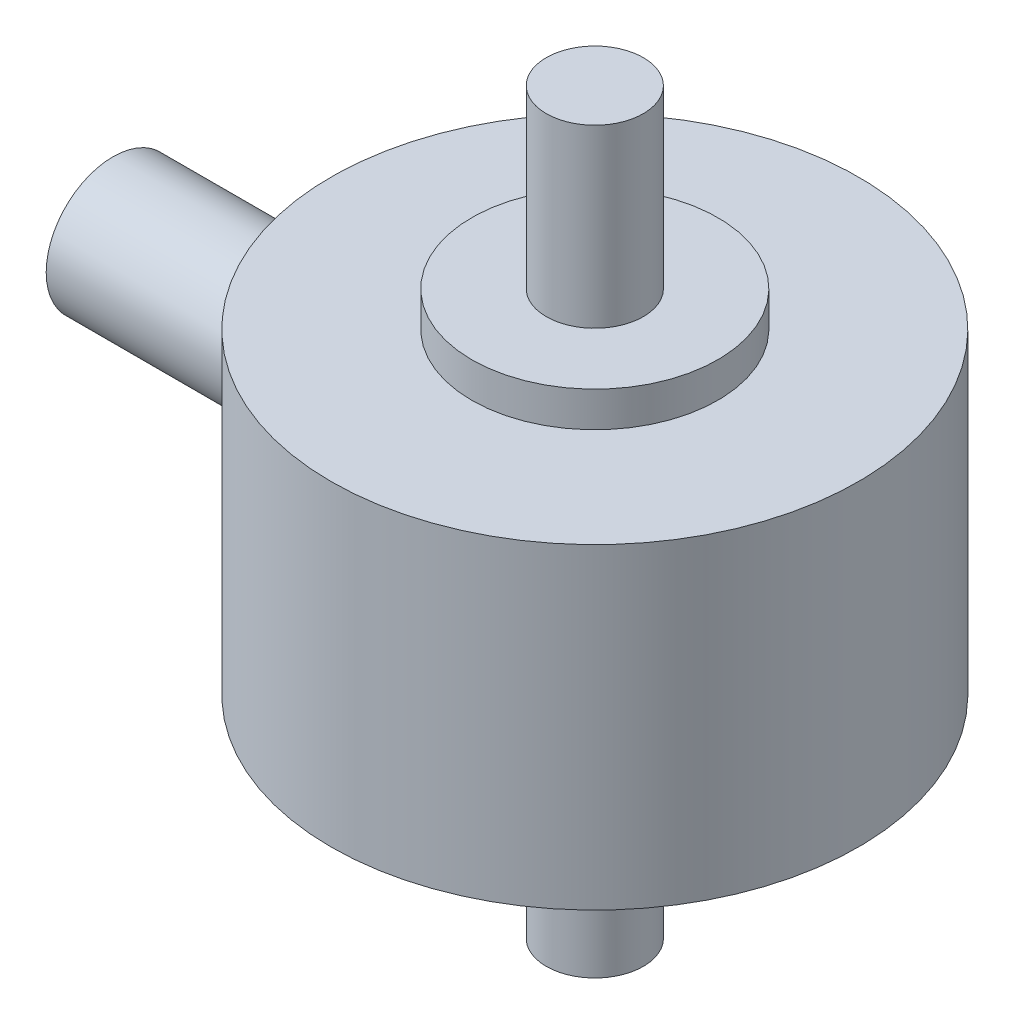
ISO-10303-21;
HEADER;
FILE_DESCRIPTION(('STEP AP214'),'2;1');
FILE_NAME('part.step','',(''),(''),'','','');
FILE_SCHEMA(('AUTOMOTIVE_DESIGN { 1 0 10303 214 1 1 1 1 }'));
ENDSEC;
DATA;
#1=APPLICATION_CONTEXT('core data for automotive mechanical design processes');
#2=APPLICATION_PROTOCOL_DEFINITION('international standard','automotive_design',2000,#1);
#3=PRODUCT_CONTEXT('',#1,'mechanical');
#4=PRODUCT('Part','Part','',(#3));
#5=PRODUCT_RELATED_PRODUCT_CATEGORY('part','',(#4));
#6=PRODUCT_DEFINITION_FORMATION('','',#4);
#7=PRODUCT_DEFINITION_CONTEXT('part definition',#1,'design');
#8=PRODUCT_DEFINITION('design','',#6,#7);
#9=PRODUCT_DEFINITION_SHAPE('','',#8);
#10=(LENGTH_UNIT() NAMED_UNIT(*) SI_UNIT(.MILLI.,.METRE.));
#11=(NAMED_UNIT(*) PLANE_ANGLE_UNIT() SI_UNIT($,.RADIAN.));
#12=(NAMED_UNIT(*) SI_UNIT($,.STERADIAN.) SOLID_ANGLE_UNIT());
#13=UNCERTAINTY_MEASURE_WITH_UNIT(LENGTH_MEASURE(1.E-05),#10,'distance_accuracy_value','');
#14=(GEOMETRIC_REPRESENTATION_CONTEXT(3) GLOBAL_UNCERTAINTY_ASSIGNED_CONTEXT((#13)) GLOBAL_UNIT_ASSIGNED_CONTEXT((#10,
#11,#12)) REPRESENTATION_CONTEXT('',''));
#15=CARTESIAN_POINT('',(0.,0.,0.));
#16=DIRECTION('',(0.,0.,1.));
#17=DIRECTION('',(1.,0.,0.));
#18=AXIS2_PLACEMENT_3D('',#15,#16,#17);
#19=CARTESIAN_POINT('',(0.,5.715,0.));
#20=DIRECTION('',(0.,-1.,0.));
#21=DIRECTION('',(0.,0.,-1.));
#22=AXIS2_PLACEMENT_3D('',#19,#20,#21);
#23=CYLINDRICAL_SURFACE('',#22,9.525);
#24=CARTESIAN_POINT('',(0.,-5.715,0.));
#25=DIRECTION('',(0.,1.,0.));
#26=DIRECTION('',(0.,0.,1.));
#27=AXIS2_PLACEMENT_3D('',#24,#25,#26);
#28=CIRCLE('',#27,9.525);
#29=CARTESIAN_POINT('',(0.,-5.715,9.525));
#30=VERTEX_POINT('',#29);
#31=EDGE_CURVE('E63',#30,#30,#28,.T.);
#32=ORIENTED_EDGE('',*,*,#31,.T.);
#33=EDGE_LOOP('',(#32));
#34=FACE_BOUND('',#33,.T.);
#35=CARTESIAN_POINT('',(0.,5.715,0.));
#36=DIRECTION('',(0.,1.,0.));
#37=DIRECTION('',(0.,0.,1.));
#38=AXIS2_PLACEMENT_3D('',#35,#36,#37);
#39=CIRCLE('',#38,9.525);
#40=CARTESIAN_POINT('',(0.,5.715,9.525));
#41=VERTEX_POINT('',#40);
#42=EDGE_CURVE('E46',#41,#41,#39,.T.);
#43=ORIENTED_EDGE('',*,*,#42,.F.);
#44=EDGE_LOOP('',(#43));
#45=FACE_BOUND('',#44,.T.);
#46=CARTESIAN_POINT('',(-9.21428543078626,0.,-2.413));
#47=CARTESIAN_POINT('',(-9.21428793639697,-0.133184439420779,-2.41299632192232));
#48=CARTESIAN_POINT('',(-9.21720456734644,-0.26640921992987,-2.40193585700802));
#49=CARTESIAN_POINT('',(-9.22852516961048,-0.529028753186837,-2.35805935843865));
#50=CARTESIAN_POINT('',(-9.23693224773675,-0.658421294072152,-2.32523100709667));
#51=CARTESIAN_POINT('',(-9.25822186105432,-0.909539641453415,-2.23895287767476));
#52=CARTESIAN_POINT('',(-9.27109851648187,-1.03127527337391,-2.1855301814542));
#53=CARTESIAN_POINT('',(-9.29986905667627,-1.26407058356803,-2.05966279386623));
#54=CARTESIAN_POINT('',(-9.31576309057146,-1.37512973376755,-1.98721716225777));
#55=CARTESIAN_POINT('',(-9.34917957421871,-1.58592848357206,-1.82361180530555));
#56=CARTESIAN_POINT('',(-9.36672860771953,-1.68539129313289,-1.73210080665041));
#57=CARTESIAN_POINT('',(-9.40124737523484,-1.86773388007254,-1.53371876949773));
#58=CARTESIAN_POINT('',(-9.41821705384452,-1.95061207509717,-1.42684626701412));
#59=CARTESIAN_POINT('',(-9.44995970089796,-2.09856951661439,-1.19887421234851));
#60=CARTESIAN_POINT('',(-9.46469764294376,-2.16337621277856,-1.07759247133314));
#61=CARTESIAN_POINT('',(-9.49001263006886,-2.27157784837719,-0.825420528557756));
#62=CARTESIAN_POINT('',(-9.50059030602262,-2.31497603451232,-0.694531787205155));
#63=CARTESIAN_POINT('',(-9.51620500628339,-2.37824036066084,-0.429747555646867));
#64=CARTESIAN_POINT('',(-9.52135258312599,-2.39857669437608,-0.295971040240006));
#65=CARTESIAN_POINT('',(-9.52591259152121,-2.41661661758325,-0.0268127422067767));
#66=CARTESIAN_POINT('',(-9.52532589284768,-2.41432363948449,0.108568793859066));
#67=CARTESIAN_POINT('',(-9.51856549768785,-2.38750682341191,0.373830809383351));
#68=CARTESIAN_POINT('',(-9.5125193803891,-2.36349060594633,0.503766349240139));
#69=CARTESIAN_POINT('',(-9.49566843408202,-2.29472578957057,0.757699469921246));
#70=CARTESIAN_POINT('',(-9.4848633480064,-2.249976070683,0.881696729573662));
#71=CARTESIAN_POINT('',(-9.45951452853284,-2.14060807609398,1.12156270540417));
#72=CARTESIAN_POINT('',(-9.44493725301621,-2.07581046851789,1.2373459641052));
#73=CARTESIAN_POINT('',(-9.41362324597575,-1.92832240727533,1.45657235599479));
#74=CARTESIAN_POINT('',(-9.39688612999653,-1.84562876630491,1.56001328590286));
#75=CARTESIAN_POINT('',(-9.36252584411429,-1.66197992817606,1.75464665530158));
#76=CARTESIAN_POINT('',(-9.34489097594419,-1.56058130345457,1.84541908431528));
#77=CARTESIAN_POINT('',(-9.31114696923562,-1.34381670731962,2.0087667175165));
#78=CARTESIAN_POINT('',(-9.29503790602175,-1.22845004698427,2.08134102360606));
#79=CARTESIAN_POINT('',(-9.266126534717,-0.986183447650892,2.20651099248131));
#80=CARTESIAN_POINT('',(-9.25334148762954,-0.859227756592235,2.25900301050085));
#81=CARTESIAN_POINT('',(-9.2327456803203,-0.59789088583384,2.34176662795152));
#82=CARTESIAN_POINT('',(-9.22493382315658,-0.463511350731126,2.37204312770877));
#83=CARTESIAN_POINT('',(-9.21539979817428,-0.19504289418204,2.40881412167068));
#84=CARTESIAN_POINT('',(-9.21351837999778,-0.0610447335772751,2.4159307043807));
#85=CARTESIAN_POINT('',(-9.2156243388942,0.206225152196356,2.40788507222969));
#86=CARTESIAN_POINT('',(-9.21961115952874,0.339496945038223,2.39272496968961));
#87=CARTESIAN_POINT('',(-9.23285153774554,0.599204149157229,2.34110235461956));
#88=CARTESIAN_POINT('',(-9.24201491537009,0.725717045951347,2.30500431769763));
#89=CARTESIAN_POINT('',(-9.26448982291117,0.970895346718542,2.21293574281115));
#90=CARTESIAN_POINT('',(-9.27780185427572,1.08955979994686,2.15696280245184));
#91=CARTESIAN_POINT('',(-9.30740778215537,1.31830212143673,2.02543888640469));
#92=CARTESIAN_POINT('',(-9.32375619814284,1.42815966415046,1.949517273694));
#93=CARTESIAN_POINT('',(-9.35746016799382,1.63380390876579,1.78071798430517));
#94=CARTESIAN_POINT('',(-9.37481589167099,1.72958822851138,1.68783744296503));
#95=CARTESIAN_POINT('',(-9.40912030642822,1.90689919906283,1.48489744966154));
#96=CARTESIAN_POINT('',(-9.42604698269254,1.98799482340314,1.37445698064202));
#97=CARTESIAN_POINT('',(-9.45712393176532,2.13049030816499,1.14116545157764));
#98=CARTESIAN_POINT('',(-9.47127435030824,2.1918912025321,1.01831504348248));
#99=CARTESIAN_POINT('',(-9.49511464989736,2.29271442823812,0.764544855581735));
#100=CARTESIAN_POINT('',(-9.50483681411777,2.33229628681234,0.633691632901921));
#101=CARTESIAN_POINT('',(-9.51886666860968,2.38883389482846,0.366911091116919));
#102=CARTESIAN_POINT('',(-9.52317543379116,2.40579413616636,0.230984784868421));
#103=CARTESIAN_POINT('',(-9.52584778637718,2.41634873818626,-0.0380386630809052));
#104=CARTESIAN_POINT('',(-9.52437303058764,2.41057842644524,-0.171109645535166));
#105=CARTESIAN_POINT('',(-9.51600391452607,2.37729481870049,-0.434320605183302));
#106=CARTESIAN_POINT('',(-9.50910972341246,2.34978220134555,-0.56446067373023));
#107=CARTESIAN_POINT('',(-9.49070278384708,2.27413945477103,-0.817431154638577));
#108=CARTESIAN_POINT('',(-9.47921641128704,2.22612696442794,-0.940298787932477));
#109=CARTESIAN_POINT('',(-9.45283293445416,2.11095366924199,-1.17630405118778));
#110=CARTESIAN_POINT('',(-9.43793539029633,2.04379039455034,-1.28944042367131));
#111=CARTESIAN_POINT('',(-9.40587755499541,1.89029971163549,-1.505773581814));
#112=CARTESIAN_POINT('',(-9.38867077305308,1.80354314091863,-1.60865898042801));
#113=CARTESIAN_POINT('',(-9.35413865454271,1.61415802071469,-1.79862656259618));
#114=CARTESIAN_POINT('',(-9.33681328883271,1.51152542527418,-1.8857047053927));
#115=CARTESIAN_POINT('',(-9.30362422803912,1.29091823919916,-2.04323817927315));
#116=CARTESIAN_POINT('',(-9.28779518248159,1.1726858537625,-2.11334038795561));
#117=CARTESIAN_POINT('',(-9.25986152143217,0.925729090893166,-2.23256926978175));
#118=CARTESIAN_POINT('',(-9.24775425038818,0.797012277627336,-2.28171090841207));
#119=CARTESIAN_POINT('',(-9.23048638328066,0.557140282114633,-2.35047862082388));
#120=CARTESIAN_POINT('',(-9.22445740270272,0.447112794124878,-2.37387227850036));
#121=CARTESIAN_POINT('',(-9.21635604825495,0.224732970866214,-2.40513381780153));
#122=CARTESIAN_POINT('',(-9.2142833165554,0.112380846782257,-2.41300310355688));
#123=CARTESIAN_POINT('',(-9.21428543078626,0.,-2.413));
#124=B_SPLINE_CURVE_WITH_KNOTS('',3,(#46,#47,#48,#49,#50,#51,#52,#53,#54,#55,#56,#57,#58,#59,
#60,#61,#62,#63,#64,#65,#66,#67,#68,#69,#70,#71,#72,#73,#74,#75,#76,#77,#78,#79,#80,#81,#82,#83,
#84,#85,#86,#87,#88,#89,#90,#91,#92,#93,#94,#95,#96,#97,#98,#99,#100,#101,#102,#103,#104,#105,
#106,#107,#108,#109,#110,#111,#112,#113,#114,#115,#116,#117,#118,#119,#120,#121,#122,#123),
.UNSPECIFIED.,.T.,.F.,(4,2,2,2,2,2,2,2,2,2,2,2,2,2,2,2,2,2,2,2,2,2,2,2,2,2,2,2,2,2,2,2,2,2,2,2,
2,2,4),(0.,0.399140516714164,0.798507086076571,1.19735026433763,1.59621315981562,
2.00320412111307,2.41023389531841,2.82310593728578,3.23591534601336,3.64014776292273,
4.04431886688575,4.43928274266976,4.83426795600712,5.23289385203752,5.63159080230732,
6.04136176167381,6.45115293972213,6.86303140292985,7.27481898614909,7.67545025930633,
8.0760435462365,8.46986432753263,8.86373272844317,9.26551179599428,9.66735879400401,
10.0795613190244,10.4917422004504,10.9008680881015,11.3099127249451,11.7076066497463,
12.1052881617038,12.5007176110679,12.896198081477,13.3013667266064,13.7066387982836,
14.1197299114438,14.5325255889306,14.8693502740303,15.2061444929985),.UNSPECIFIED.);
#125=CARTESIAN_POINT('',(-9.21428543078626,0.,-2.413));
#126=VERTEX_POINT('',#125);
#127=EDGE_CURVE('E10',#126,#126,#124,.T.);
#128=ORIENTED_EDGE('',*,*,#127,.F.);
#129=EDGE_LOOP('',(#128));
#130=FACE_BOUND('',#129,.T.);
#131=ADVANCED_FACE('F28',(#34,#45,#130),#23,.T.);
#132=CARTESIAN_POINT('',(0.,6.985,0.));
#133=DIRECTION('',(0.,1.,0.));
#134=DIRECTION('',(0.,0.,1.));
#135=AXIS2_PLACEMENT_3D('',#132,#133,#134);
#136=PLANE('',#135);
#137=CARTESIAN_POINT('',(0.,6.985,0.));
#138=DIRECTION('',(0.,1.,0.));
#139=DIRECTION('',(0.,0.,1.));
#140=AXIS2_PLACEMENT_3D('',#137,#138,#139);
#141=CIRCLE('',#140,4.445);
#142=CARTESIAN_POINT('',(0.,6.985,4.445));
#143=VERTEX_POINT('',#142);
#144=EDGE_CURVE('E51',#143,#143,#141,.T.);
#145=ORIENTED_EDGE('',*,*,#144,.T.);
#146=EDGE_LOOP('',(#145));
#147=FACE_BOUND('',#146,.T.);
#148=CARTESIAN_POINT('',(0.,6.985,0.));
#149=DIRECTION('',(0.,1.,0.));
#150=DIRECTION('',(0.,0.,1.));
#151=AXIS2_PLACEMENT_3D('',#148,#149,#150);
#152=CIRCLE('',#151,1.7526);
#153=CARTESIAN_POINT('',(0.,6.985,1.7526));
#154=VERTEX_POINT('',#153);
#155=EDGE_CURVE('E60',#154,#154,#152,.T.);
#156=ORIENTED_EDGE('',*,*,#155,.F.);
#157=EDGE_LOOP('',(#156));
#158=FACE_BOUND('',#157,.T.);
#159=ADVANCED_FACE('F91',(#147,#158),#136,.T.);
#160=CARTESIAN_POINT('',(0.,5.715,0.));
#161=DIRECTION('',(0.,1.,0.));
#162=DIRECTION('',(0.,0.,1.));
#163=AXIS2_PLACEMENT_3D('',#160,#161,#162);
#164=PLANE('',#163);
#165=ORIENTED_EDGE('',*,*,#42,.T.);
#166=EDGE_LOOP('',(#165));
#167=FACE_BOUND('',#166,.T.);
#168=CARTESIAN_POINT('',(0.,5.715,0.));
#169=DIRECTION('',(0.,1.,0.));
#170=DIRECTION('',(0.,0.,1.));
#171=AXIS2_PLACEMENT_3D('',#168,#169,#170);
#172=CIRCLE('',#171,4.445);
#173=CARTESIAN_POINT('',(0.,5.715,4.445));
#174=VERTEX_POINT('',#173);
#175=EDGE_CURVE('E54',#174,#174,#172,.T.);
#176=ORIENTED_EDGE('',*,*,#175,.F.);
#177=EDGE_LOOP('',(#176));
#178=FACE_BOUND('',#177,.T.);
#179=ADVANCED_FACE('F96',(#167,#178),#164,.T.);
#180=CARTESIAN_POINT('',(0.,6.985,0.));
#181=DIRECTION('',(0.,-1.,0.));
#182=DIRECTION('',(0.,0.,-1.));
#183=AXIS2_PLACEMENT_3D('',#180,#181,#182);
#184=CYLINDRICAL_SURFACE('',#183,4.445);
#185=ORIENTED_EDGE('',*,*,#144,.F.);
#186=EDGE_LOOP('',(#185));
#187=FACE_BOUND('',#186,.T.);
#188=ORIENTED_EDGE('',*,*,#175,.T.);
#189=EDGE_LOOP('',(#188));
#190=FACE_BOUND('',#189,.T.);
#191=ADVANCED_FACE('F106',(#187,#190),#184,.T.);
#192=CARTESIAN_POINT('',(0.,13.335,0.));
#193=DIRECTION('',(0.,-1.,0.));
#194=DIRECTION('',(0.,0.,-1.));
#195=AXIS2_PLACEMENT_3D('',#192,#193,#194);
#196=CYLINDRICAL_SURFACE('',#195,1.7526);
#197=CARTESIAN_POINT('',(0.,13.335,0.));
#198=DIRECTION('',(0.,1.,0.));
#199=DIRECTION('',(0.,0.,1.));
#200=AXIS2_PLACEMENT_3D('',#197,#198,#199);
#201=CIRCLE('',#200,1.7526);
#202=CARTESIAN_POINT('',(0.,13.335,1.7526));
#203=VERTEX_POINT('',#202);
#204=EDGE_CURVE('E57',#203,#203,#201,.T.);
#205=ORIENTED_EDGE('',*,*,#204,.F.);
#206=EDGE_LOOP('',(#205));
#207=FACE_BOUND('',#206,.T.);
#208=ORIENTED_EDGE('',*,*,#155,.T.);
#209=EDGE_LOOP('',(#208));
#210=FACE_BOUND('',#209,.T.);
#211=ADVANCED_FACE('F110',(#207,#210),#196,.T.);
#212=CARTESIAN_POINT('',(0.,13.335,0.));
#213=DIRECTION('',(0.,1.,0.));
#214=DIRECTION('',(0.,0.,1.));
#215=AXIS2_PLACEMENT_3D('',#212,#213,#214);
#216=PLANE('',#215);
#217=ORIENTED_EDGE('',*,*,#204,.T.);
#218=EDGE_LOOP('',(#217));
#219=FACE_BOUND('',#218,.T.);
#220=ADVANCED_FACE('F116',(#219),#216,.T.);
#221=CARTESIAN_POINT('',(0.,-5.715,0.));
#222=DIRECTION('',(0.,-1.,0.));
#223=DIRECTION('',(0.,0.,1.));
#224=AXIS2_PLACEMENT_3D('',#221,#222,#223);
#225=PLANE('',#224);
#226=CARTESIAN_POINT('',(0.,-5.715,0.));
#227=DIRECTION('',(0.,-1.,0.));
#228=DIRECTION('',(0.,0.,-1.));
#229=AXIS2_PLACEMENT_3D('',#226,#227,#228);
#230=CIRCLE('',#229,4.445);
#231=CARTESIAN_POINT('',(0.,-5.715,-4.445));
#232=VERTEX_POINT('',#231);
#233=EDGE_CURVE('E42',#232,#232,#230,.T.);
#234=ORIENTED_EDGE('',*,*,#233,.F.);
#235=EDGE_LOOP('',(#234));
#236=FACE_BOUND('',#235,.T.);
#237=ORIENTED_EDGE('',*,*,#31,.F.);
#238=EDGE_LOOP('',(#237));
#239=FACE_BOUND('',#238,.T.);
#240=ADVANCED_FACE('F123',(#236,#239),#225,.T.);
#241=CARTESIAN_POINT('',(0.,-6.985,0.));
#242=DIRECTION('',(0.,1.,0.));
#243=DIRECTION('',(0.,0.,1.));
#244=AXIS2_PLACEMENT_3D('',#241,#242,#243);
#245=CYLINDRICAL_SURFACE('',#244,4.445);
#246=CARTESIAN_POINT('',(0.,-6.985,0.));
#247=DIRECTION('',(0.,1.,0.));
#248=DIRECTION('',(0.,0.,1.));
#249=AXIS2_PLACEMENT_3D('',#246,#247,#248);
#250=CIRCLE('',#249,4.445);
#251=CARTESIAN_POINT('',(0.,-6.985,4.445));
#252=VERTEX_POINT('',#251);
#253=EDGE_CURVE('E66',#252,#252,#250,.T.);
#254=ORIENTED_EDGE('',*,*,#253,.T.);
#255=EDGE_LOOP('',(#254));
#256=FACE_BOUND('',#255,.T.);
#257=ORIENTED_EDGE('',*,*,#233,.T.);
#258=EDGE_LOOP('',(#257));
#259=FACE_BOUND('',#258,.T.);
#260=ADVANCED_FACE('F127',(#256,#259),#245,.T.);
#261=CARTESIAN_POINT('',(0.,-6.985,0.));
#262=DIRECTION('',(0.,-1.,0.));
#263=DIRECTION('',(0.,0.,1.));
#264=AXIS2_PLACEMENT_3D('',#261,#262,#263);
#265=PLANE('',#264);
#266=CARTESIAN_POINT('',(0.,-6.985,0.));
#267=DIRECTION('',(0.,-1.,0.));
#268=DIRECTION('',(0.,0.,-1.));
#269=AXIS2_PLACEMENT_3D('',#266,#267,#268);
#270=CIRCLE('',#269,1.7526);
#271=CARTESIAN_POINT('',(0.,-6.985,-1.7526));
#272=VERTEX_POINT('',#271);
#273=EDGE_CURVE('E38',#272,#272,#270,.T.);
#274=ORIENTED_EDGE('',*,*,#273,.F.);
#275=EDGE_LOOP('',(#274));
#276=FACE_BOUND('',#275,.T.);
#277=ORIENTED_EDGE('',*,*,#253,.F.);
#278=EDGE_LOOP('',(#277));
#279=FACE_BOUND('',#278,.T.);
#280=ADVANCED_FACE('F131',(#276,#279),#265,.T.);
#281=CARTESIAN_POINT('',(0.,-13.335,0.));
#282=DIRECTION('',(0.,1.,0.));
#283=DIRECTION('',(0.,0.,1.));
#284=AXIS2_PLACEMENT_3D('',#281,#282,#283);
#285=CYLINDRICAL_SURFACE('',#284,1.7526);
#286=CARTESIAN_POINT('',(0.,-13.335,0.));
#287=DIRECTION('',(0.,1.,0.));
#288=DIRECTION('',(0.,0.,1.));
#289=AXIS2_PLACEMENT_3D('',#286,#287,#288);
#290=CIRCLE('',#289,1.7526);
#291=CARTESIAN_POINT('',(0.,-13.335,1.7526));
#292=VERTEX_POINT('',#291);
#293=EDGE_CURVE('E69',#292,#292,#290,.T.);
#294=ORIENTED_EDGE('',*,*,#293,.T.);
#295=EDGE_LOOP('',(#294));
#296=FACE_BOUND('',#295,.T.);
#297=ORIENTED_EDGE('',*,*,#273,.T.);
#298=EDGE_LOOP('',(#297));
#299=FACE_BOUND('',#298,.T.);
#300=ADVANCED_FACE('F86',(#296,#299),#285,.T.);
#301=CARTESIAN_POINT('',(0.,-13.335,0.));
#302=DIRECTION('',(0.,-1.,0.));
#303=DIRECTION('',(0.,0.,1.));
#304=AXIS2_PLACEMENT_3D('',#301,#302,#303);
#305=PLANE('',#304);
#306=ORIENTED_EDGE('',*,*,#293,.F.);
#307=EDGE_LOOP('',(#306));
#308=FACE_BOUND('',#307,.T.);
#309=ADVANCED_FACE('F80',(#308),#305,.T.);
#310=CARTESIAN_POINT('',(-17.399,0.,0.));
#311=DIRECTION('',(1.,0.,0.));
#312=DIRECTION('',(0.,0.,-1.));
#313=AXIS2_PLACEMENT_3D('',#310,#311,#312);
#314=CYLINDRICAL_SURFACE('',#313,2.413);
#315=CARTESIAN_POINT('',(-17.399,0.,0.));
#316=DIRECTION('',(-1.,0.,0.));
#317=DIRECTION('',(0.,0.,1.));
#318=AXIS2_PLACEMENT_3D('',#315,#316,#317);
#319=CIRCLE('',#318,2.413);
#320=CARTESIAN_POINT('',(-17.399,0.,2.413));
#321=VERTEX_POINT('',#320);
#322=EDGE_CURVE('E72',#321,#321,#319,.T.);
#323=ORIENTED_EDGE('',*,*,#322,.F.);
#324=EDGE_LOOP('',(#323));
#325=FACE_BOUND('',#324,.T.);
#326=ORIENTED_EDGE('',*,*,#127,.T.);
#327=EDGE_LOOP('',(#326));
#328=FACE_BOUND('',#327,.T.);
#329=ADVANCED_FACE('F78',(#325,#328),#314,.T.);
#330=CARTESIAN_POINT('',(-17.399,0.,0.));
#331=DIRECTION('',(-1.,0.,0.));
#332=DIRECTION('',(0.,0.,1.));
#333=AXIS2_PLACEMENT_3D('',#330,#331,#332);
#334=PLANE('',#333);
#335=ORIENTED_EDGE('',*,*,#322,.T.);
#336=EDGE_LOOP('',(#335));
#337=FACE_BOUND('',#336,.T.);
#338=ADVANCED_FACE('F76',(#337),#334,.T.);
#339=CLOSED_SHELL('',(#131,#159,#179,#191,#211,#220,#240,#260,#280,#300,#309,#329,#338));
#340=MANIFOLD_SOLID_BREP('B2',#339);
#341=ADVANCED_BREP_SHAPE_REPRESENTATION('',(#18,#340),#14);
#342=SHAPE_DEFINITION_REPRESENTATION(#9,#341);
ENDSEC;
END-ISO-10303-21;
